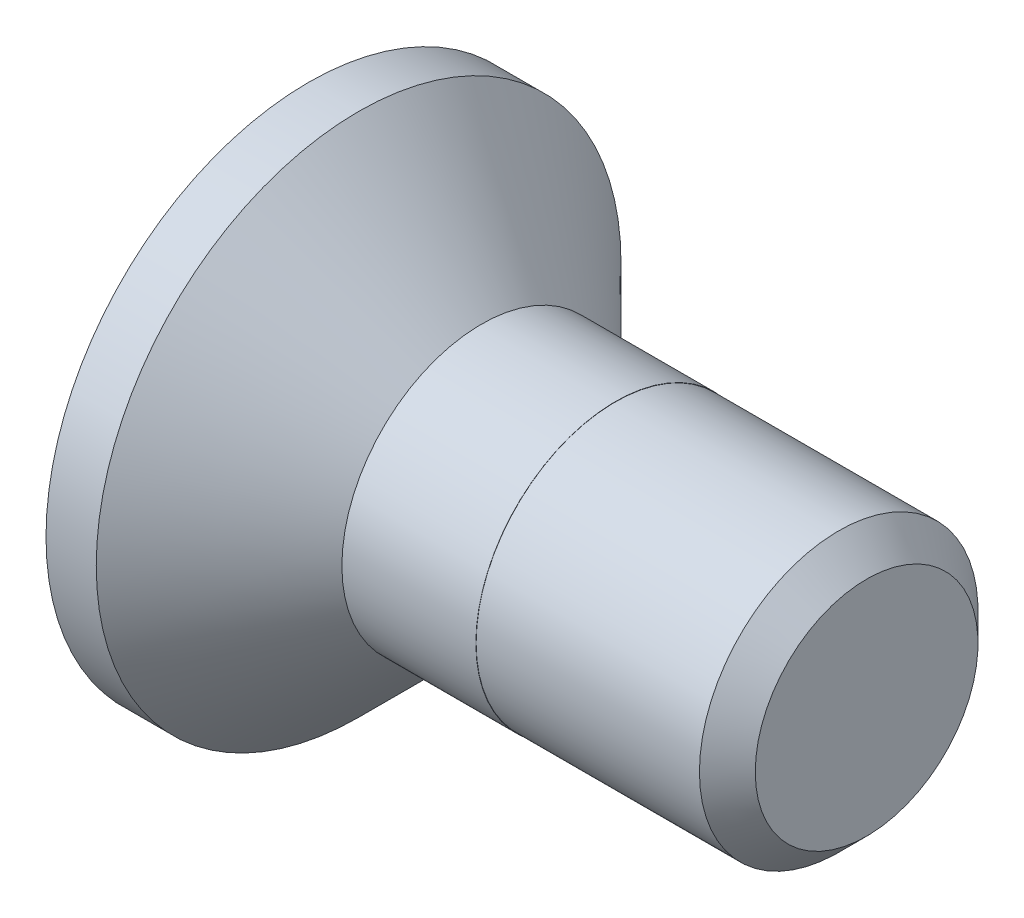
from build123d import *

# Parameters (mm, degrees)
LINEAR_AUSTRAGEN1_DEPTH = 2.1


with BuildPart() as part:
    # Skizze1 → Rotation1 (revolve)
    with BuildSketch(Plane.XY, mode=Mode.PRIVATE) as rotation1_sk:
        Polygon((0, 2), (0, 4.7), (0.9, 4.7), (3.1, 2.5), (5.5, 2.5), (5.5, 2.495), (9.5, 2.495), (10, 1.995), (10, 0), (2.966025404, 0), (2.1, 1.5), (0.3, 1.5), align=None)
    revolve(rotation1_sk.sketch.rotate(Axis((0, 0, 0), (1, 0, 0)), 90), axis=Axis((0, 0, 0), (1, 0, 0)))

    # Skizze2 → Linear austragen1 (cut)
    with BuildSketch(Plane.ZY):
        Polygon((1.732050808, 0), (0.866025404, 1.5), (-0.866025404, 1.5), (-1.732050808, 0), (-0.866025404, -1.5), (0.866025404, -1.5), align=None)
    extrude(amount=-LINEAR_AUSTRAGEN1_DEPTH, mode=Mode.SUBTRACT)


solid = part.part
